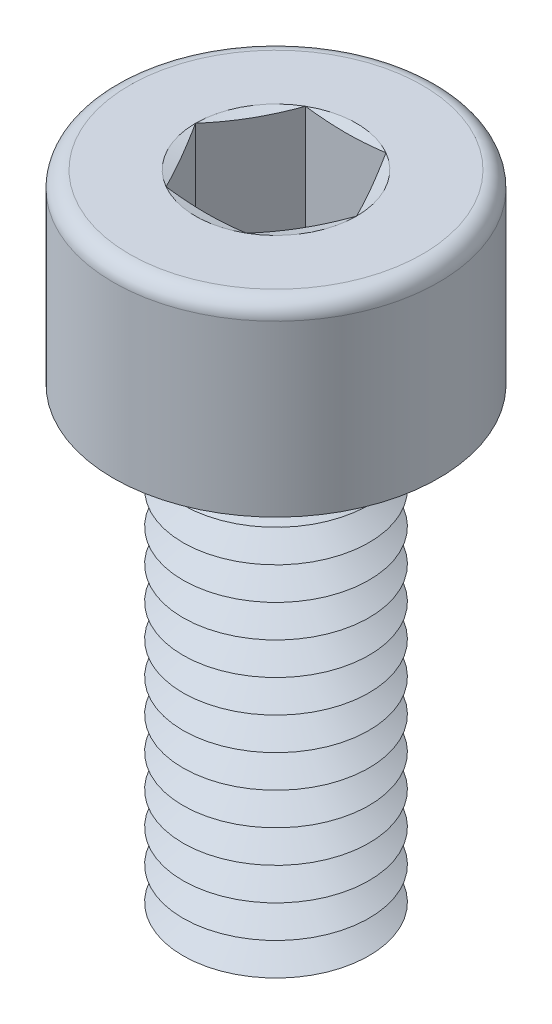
from build123d import *

# Parameters (mm, degrees)
SKETCH1_R       = 2
EXTRUDE1_DEPTH  = 10
SKETCH2_R       = 3.5
EXTRUDE2_DEPTH  = 4
EXTRUDE3_DEPTH  = 3
FILLET1_R       = 0.35
LPATTERN1_COUNT = 14
LPATTERN1_PITCH = 0.7


with BuildPart() as part:
    # Sketch1 → Extrude1 (new body)
    with BuildSketch(Plane(origin=(0, 0, 0), x_dir=(1, 0, 0), z_dir=(0, 1, 0))):
        with Locations(Location((0, 0, 0), (0, 0, 270))):
            Circle(SKETCH1_R)
    extrude(amount=EXTRUDE1_DEPTH)

    # Sketch2 → Extrude2 (add)
    with BuildSketch(Plane(origin=(0, 10, 0), x_dir=(1, 0, 0), z_dir=(0, 1, 0))):
        with Locations(Location((0, 0, 0), (0, 0, 270))):
            Circle(SKETCH2_R)
    extrude(amount=EXTRUDE2_DEPTH)

    # Sketch3 → Extrude3 (cut)
    with BuildSketch(Plane(origin=(0, 14, 0), x_dir=(1, 0, 0), z_dir=(0, 1, 0))):
        Polygon((0.866025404, 1.5), (-0.866025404, 1.5), (-1.732050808, 0), (-0.866025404, -1.5), (0.866025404, -1.5), (1.732050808, 0), align=None)
    extrude(amount=-EXTRUDE3_DEPTH, mode=Mode.SUBTRACT)

    # Fillet1
    fillet1_edges = [part.edges().sort_by_distance(p)[0] for p in [
        (0, 14, -3.5),
    ]]
    fillet(fillet1_edges, radius=FILLET1_R)

    # Sketch4 → Cut-Revolve1 (revolve, cut)
    with BuildSketch(Plane(origin=(0, 0, 0), x_dir=(0, 0, -1), z_dir=(1, 0, 0))):
        Polygon((-1.5, 11), (0, 11), (0, 10.133974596), align=None)
    revolve(axis=Axis((0, 11, 0), (0, -1, 0)), mode=Mode.SUBTRACT)

    # Sketch5 → Cut-Revolve2 (revolve, cut)
    with BuildSketch(Plane.XY, mode=Mode.PRIVATE) as cut_revolve2_sk:
        Polygon((-2, 0.35), (-2, -0.35), (-1.393782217, 0), align=None)
    cut_revolve2 = revolve(cut_revolve2_sk.sketch.rotate(Axis((0, 10, 0), (0, -1, 0)), 270), axis=Axis((0, 10, 0), (0, -1, 0)), mode=Mode.SUBTRACT)

    # LPattern1: Cut-Revolve2 ×14
    with Locations(*[(0, i * LPATTERN1_PITCH, 0) for i in range(1, LPATTERN1_COUNT)]):
        add(cut_revolve2, mode=Mode.SUBTRACT)

    # Extrude4 cone 1 section (on through the dimple's axis) → Extrude4 (revolve, cut)
    with BuildSketch(Plane(origin=(0, 14, 0), x_dir=(0, 0, 1), z_dir=(1, 0, 0))):
        Polygon((0, 0), (1.732050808, 0), (0, 0.464101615), align=None)
    revolve(axis=Axis((0, 14, 0), (0, -1, 0)), mode=Mode.SUBTRACT)


solid = part.part
